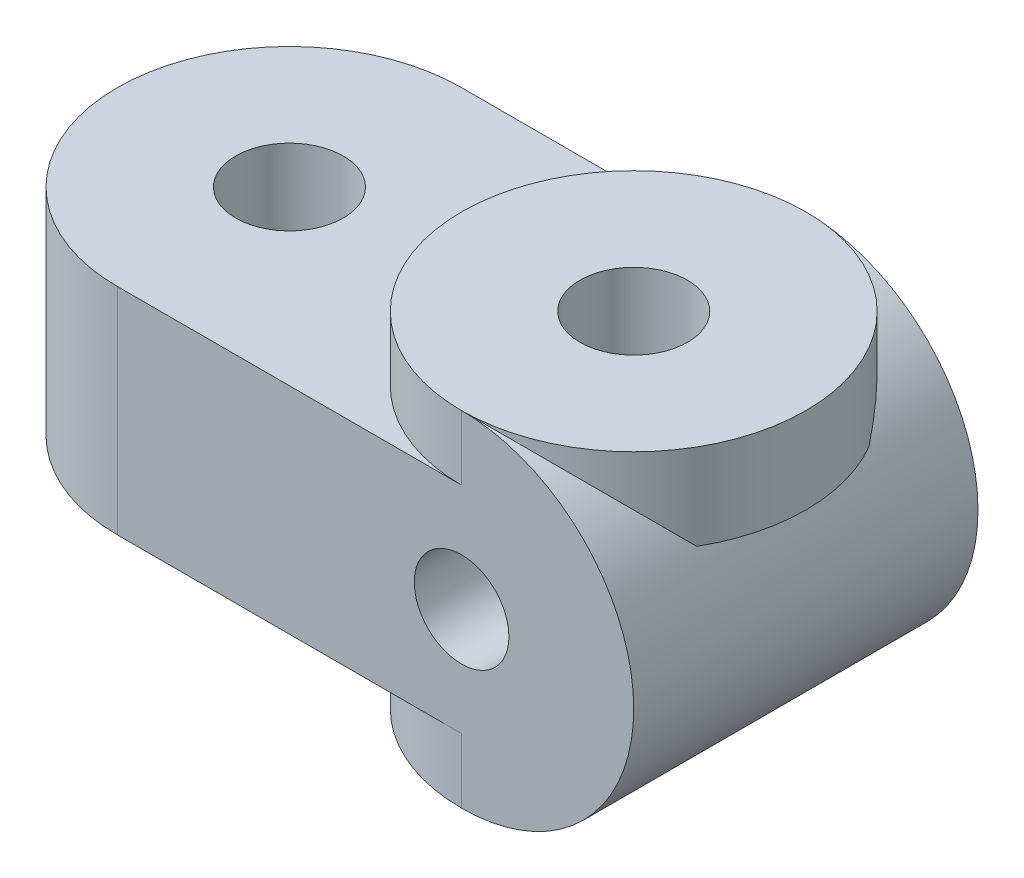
from build123d import *
from build123d.topology import SkipClean

# Parameters (mm, degrees)
SKETCH1_R           = 4
SKETCH1_R_2         = 1.1
BOSS_EXTRUDE1_DEPTH = 8
SKETCH2_W           = 8
SKETCH2_H           = 8
BOSS_EXTRUDE2_DEPTH = 12
SKETCH4_R           = 4
SKETCH4_R_2         = 1.25
BOSS_EXTRUDE3_DEPTH = 2
SKETCH4_4_R         = 1.25
CUT_EXTRUDE1_DEPTH  = 8
SKETCH1_3_R         = 1.1
CUT_EXTRUDE2_DEPTH  = 8
SKETCH6_R           = 1.25
CUT_EXTRUDE3_DEPTH  = 1.5


with BuildPart() as part:
    # Sketch1 → Boss-Extrude1 (new body)
    with BuildSketch(Plane.XY):
        Circle(SKETCH1_R)
        Circle(SKETCH1_R_2, mode=Mode.SUBTRACT)
    extrude(amount=-BOSS_EXTRUDE1_DEPTH)

    # Sketch2 → Boss-Extrude2 (add)
    with BuildSketch(Plane(origin=(0, 0, 0), x_dir=(0, 0, -1), z_dir=(1, 0, 0))):
        with Locations((4, 0)):
            Rectangle(SKETCH2_W, SKETCH2_H)
    extrude(amount=-BOSS_EXTRUDE2_DEPTH)

    # Sketch4 → Boss-Extrude3 (add)
    with BuildSketch(Plane(origin=(0, 4, 0), x_dir=(1, 0, 0), z_dir=(0, 1, 0))):
        with Locations((0, 4)):
            Circle(SKETCH4_R)
        with Locations((0, 4)):
            Circle(SKETCH4_R_2, mode=Mode.SUBTRACT)
    extrude(amount=-BOSS_EXTRUDE3_DEPTH)

    # Sketch4_4 → Cut-Extrude1 (cut)
    with SkipClean():  # the faces are left unmerged after this step: merging them gives an invalid solid
        with BuildSketch(Plane(origin=(0, 4, 0), x_dir=(1, 0, 0), z_dir=(0, 1, 0))):
            with BuildLine():
                Line((0, 2.75), (0, 5.25))
                ThreePointArc((0, 5.25), (-1.25, 4), (0, 2.75))
            make_face()
            with BuildLine():
                ThreePointArc((1.25, 4), (0.883883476, 4.883883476), (0, 5.25))
                Line((0, 5.25), (0, 2.75))
                ThreePointArc((0, 2.75), (0.883883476, 3.116116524), (1.25, 4))
            make_face()
            with BuildLine():
                Line((0, 2.75), (0, 5.25))
                ThreePointArc((0, 5.25), (-1.25, 4), (0, 2.75))
            make_face()
            with BuildLine():
                ThreePointArc((1.25, 4), (0.883883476, 4.883883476), (0, 5.25))
                Line((0, 5.25), (0, 2.75))
                ThreePointArc((0, 2.75), (0.883883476, 3.116116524), (1.25, 4))
            make_face()
            with Locations(Location((-8, 4, 0), (0, 0, 270))):
                Circle(SKETCH4_4_R)
            with BuildLine():
                ThreePointArc((-8, 0), (-10.828427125, 1.171572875), (-12, 4))
                Line((-12, 4), (-12, 0))
                Line((-12, 0), (-8, 0))
            make_face()
            with BuildLine():
                ThreePointArc((-12, 4), (-10.828427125, 6.828427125), (-8, 8))
                Line((-8, 8), (-12, 8))
                Line((-12, 8), (-12, 4))
            make_face()
        extrude(amount=-CUT_EXTRUDE1_DEPTH, mode=Mode.SUBTRACT)

    # Sketch1_3 → Cut-Extrude2 (cut)
    with BuildSketch(Plane.XY):
        Circle(SKETCH1_3_R)
    extrude(amount=-CUT_EXTRUDE2_DEPTH, mode=Mode.SUBTRACT)

    # Sketch6 → Cut-Extrude3 (cut)
    with BuildSketch(Plane(origin=(0, 4, 0), x_dir=(1, 0, 0), z_dir=(0, 1, 0))):
        with BuildLine():
            ThreePointArc((0, 0), (-4, 4), (0, 8))
            Line((0, 8), (-8, 8))
            ThreePointArc((-8, 8), (-12, 4), (-8, 0))
            Line((-8, 0), (0, 0))
        make_face()
        with Locations(Location((-8, 4, 0), (0, 0, 270))):
            Circle(SKETCH6_R, mode=Mode.SUBTRACT)
    cut_extrude3 = extrude(amount=-CUT_EXTRUDE3_DEPTH, mode=Mode.SUBTRACT)

    # Mirror1: Cut-Extrude3 across plane
    add(cut_extrude3.mirror(Plane.ZX), mode=Mode.SUBTRACT)


solid = part.part
